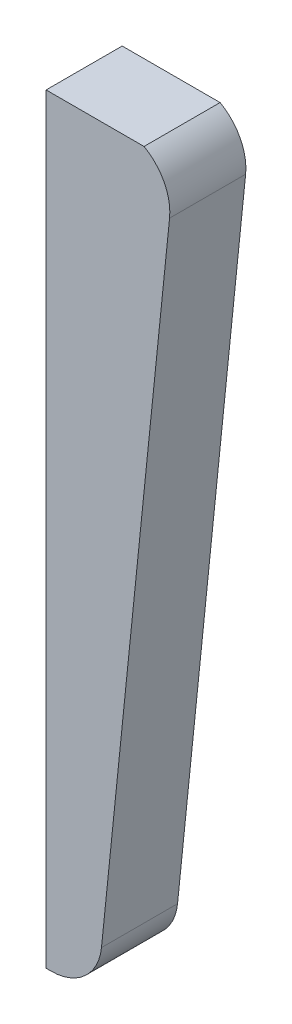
from build123d import *

# Parameters (mm, degrees)
BOSS_EXTRU_1_DEPTH = 3


with BuildPart() as part:
    # Esquisse1 → Boss.-Extru.1 (new body)
    with BuildSketch(Plane.XY):
        with BuildLine():
            Line((-0.554939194, -2.348623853), (3.307287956, -2.348623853))
            ThreePointArc((3.307287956, -2.348623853), (4.100701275, -3.171205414), (4.314119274, -4.293968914))
            Line((4.314119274, -4.293968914), (1.628785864, -30.552096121))
            ThreePointArc((1.628785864, -30.552096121), (0.979509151, -31.83303359), (-0.360836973, -32.348623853))
            Line((-0.360836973, -32.348623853), (-0.554939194, -32.348623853))
            Line((-0.554939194, -32.348623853), (-0.554939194, -2.348623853))
        make_face()
    extrude(amount=BOSS_EXTRU_1_DEPTH)


solid = part.part
